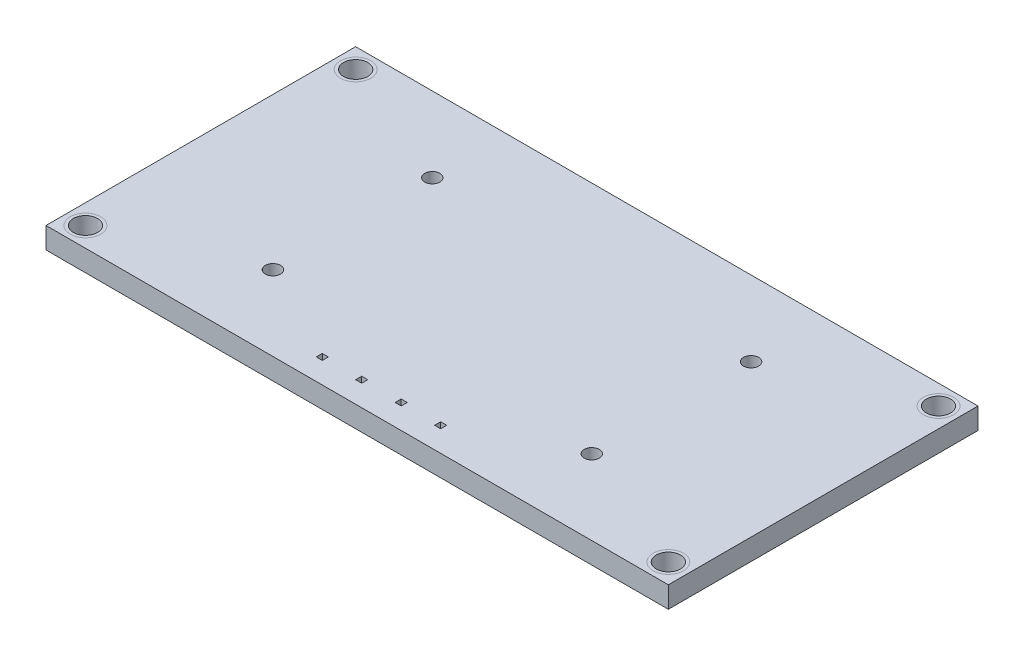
ISO-10303-21;
HEADER;
FILE_DESCRIPTION(('STEP AP214'),'2;1');
FILE_NAME('part.step','',(''),(''),'','','');
FILE_SCHEMA(('AUTOMOTIVE_DESIGN { 1 0 10303 214 1 1 1 1 }'));
ENDSEC;
DATA;
#1=APPLICATION_CONTEXT('core data for automotive mechanical design processes');
#2=APPLICATION_PROTOCOL_DEFINITION('international standard','automotive_design',2000,#1);
#3=PRODUCT_CONTEXT('',#1,'mechanical');
#4=PRODUCT('Part','Part','',(#3));
#5=PRODUCT_RELATED_PRODUCT_CATEGORY('part','',(#4));
#6=PRODUCT_DEFINITION_FORMATION('','',#4);
#7=PRODUCT_DEFINITION_CONTEXT('part definition',#1,'design');
#8=PRODUCT_DEFINITION('design','',#6,#7);
#9=PRODUCT_DEFINITION_SHAPE('','',#8);
#10=(LENGTH_UNIT() NAMED_UNIT(*) SI_UNIT(.MILLI.,.METRE.));
#11=(NAMED_UNIT(*) PLANE_ANGLE_UNIT() SI_UNIT($,.RADIAN.));
#12=(NAMED_UNIT(*) SI_UNIT($,.STERADIAN.) SOLID_ANGLE_UNIT());
#13=UNCERTAINTY_MEASURE_WITH_UNIT(LENGTH_MEASURE(1.E-05),#10,'distance_accuracy_value','');
#14=(GEOMETRIC_REPRESENTATION_CONTEXT(3) GLOBAL_UNCERTAINTY_ASSIGNED_CONTEXT((#13)) GLOBAL_UNIT_ASSIGNED_CONTEXT((#10,
#11,#12)) REPRESENTATION_CONTEXT('',''));
#15=CARTESIAN_POINT('',(0.,0.,0.));
#16=DIRECTION('',(0.,0.,1.));
#17=DIRECTION('',(1.,0.,0.));
#18=AXIS2_PLACEMENT_3D('',#15,#16,#17);
#19=CARTESIAN_POINT('',(19.2,1.4,-8.9));
#20=DIRECTION('',(0.,-1.,0.));
#21=DIRECTION('',(0.,0.,-1.));
#22=AXIS2_PLACEMENT_3D('',#19,#20,#21);
#23=CYLINDRICAL_SURFACE('',#22,0.800000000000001);
#24=CARTESIAN_POINT('',(19.2,0.,-8.9));
#25=DIRECTION('',(0.,-1.,0.));
#26=DIRECTION('',(0.,0.,-1.));
#27=AXIS2_PLACEMENT_3D('',#24,#25,#26);
#28=CIRCLE('',#27,0.800000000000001);
#29=CARTESIAN_POINT('',(19.2,0.,-9.7));
#30=VERTEX_POINT('',#29);
#31=EDGE_CURVE('P0_E28',#30,#30,#28,.T.);
#32=ORIENTED_EDGE('',*,*,#31,.T.);
#33=EDGE_LOOP('',(#32));
#34=FACE_BOUND('',#33,.T.);
#35=CARTESIAN_POINT('',(19.2,1.4,-8.9));
#36=DIRECTION('',(0.,-1.,0.));
#37=DIRECTION('',(0.,0.,-1.));
#38=AXIS2_PLACEMENT_3D('',#35,#36,#37);
#39=CIRCLE('',#38,0.800000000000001);
#40=CARTESIAN_POINT('',(19.2,1.4,-9.7));
#41=VERTEX_POINT('',#40);
#42=EDGE_CURVE('P0_E19',#41,#41,#39,.T.);
#43=ORIENTED_EDGE('',*,*,#42,.F.);
#44=EDGE_LOOP('',(#43));
#45=FACE_BOUND('',#44,.T.);
#46=ADVANCED_FACE('P0_F15',(#34,#45),#23,.F.);
#47=CARTESIAN_POINT('',(0.,1.4,0.));
#48=DIRECTION('',(0.,1.,0.));
#49=DIRECTION('',(0.,0.,1.));
#50=AXIS2_PLACEMENT_3D('',#47,#48,#49);
#51=PLANE('',#50);
#52=ORIENTED_EDGE('',*,*,#42,.T.);
#53=EDGE_LOOP('',(#52));
#54=FACE_BOUND('',#53,.T.);
#55=CARTESIAN_POINT('',(19.2,1.4,-8.9));
#56=DIRECTION('',(0.,1.,0.));
#57=DIRECTION('',(0.,0.,1.));
#58=AXIS2_PLACEMENT_3D('',#55,#56,#57);
#59=CIRCLE('',#58,1.);
#60=CARTESIAN_POINT('',(19.2,1.4,-7.9));
#61=VERTEX_POINT('',#60);
#62=EDGE_CURVE('P0_E23',#61,#61,#59,.F.);
#63=ORIENTED_EDGE('',*,*,#62,.F.);
#64=EDGE_LOOP('',(#63));
#65=FACE_BOUND('',#64,.T.);
#66=ADVANCED_FACE('P0_F36',(#54,#65),#51,.T.);
#67=CARTESIAN_POINT('',(0.,0.,0.));
#68=DIRECTION('',(0.,1.,0.));
#69=DIRECTION('',(0.,0.,1.));
#70=AXIS2_PLACEMENT_3D('',#67,#68,#69);
#71=PLANE('',#70);
#72=ORIENTED_EDGE('',*,*,#31,.F.);
#73=EDGE_LOOP('',(#72));
#74=FACE_BOUND('',#73,.T.);
#75=CARTESIAN_POINT('',(19.2,0.,-8.9));
#76=DIRECTION('',(0.,1.,0.));
#77=DIRECTION('',(0.,0.,1.));
#78=AXIS2_PLACEMENT_3D('',#75,#76,#77);
#79=CIRCLE('',#78,1.);
#80=CARTESIAN_POINT('',(19.2,0.,-7.9));
#81=VERTEX_POINT('',#80);
#82=EDGE_CURVE('P0_E10',#81,#81,#79,.T.);
#83=ORIENTED_EDGE('',*,*,#82,.F.);
#84=EDGE_LOOP('',(#83));
#85=FACE_BOUND('',#84,.T.);
#86=ADVANCED_FACE('P0_F45',(#74,#85),#71,.F.);
#87=CARTESIAN_POINT('',(19.2,1.4,-8.9));
#88=DIRECTION('',(0.,1.,0.));
#89=DIRECTION('',(0.,0.,1.));
#90=AXIS2_PLACEMENT_3D('',#87,#88,#89);
#91=CYLINDRICAL_SURFACE('',#90,1.);
#92=ORIENTED_EDGE('',*,*,#82,.T.);
#93=EDGE_LOOP('',(#92));
#94=FACE_BOUND('',#93,.T.);
#95=ORIENTED_EDGE('',*,*,#62,.T.);
#96=EDGE_LOOP('',(#95));
#97=FACE_BOUND('',#96,.T.);
#98=ADVANCED_FACE('P0_F17',(#94,#97),#91,.T.);
#99=CLOSED_SHELL('',(#46,#66,#86,#98));
#100=MANIFOLD_SOLID_BREP('P0_B1',#99);
#101=CARTESIAN_POINT('',(-19.2,1.4,-8.9));
#102=DIRECTION('',(0.,-1.,0.));
#103=DIRECTION('',(0.,0.,-1.));
#104=AXIS2_PLACEMENT_3D('',#101,#102,#103);
#105=CYLINDRICAL_SURFACE('',#104,0.800000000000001);
#106=CARTESIAN_POINT('',(-19.2,0.,-8.9));
#107=DIRECTION('',(0.,-1.,0.));
#108=DIRECTION('',(0.,0.,-1.));
#109=AXIS2_PLACEMENT_3D('',#106,#107,#108);
#110=CIRCLE('',#109,0.800000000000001);
#111=CARTESIAN_POINT('',(-19.2,0.,-9.7));
#112=VERTEX_POINT('',#111);
#113=EDGE_CURVE('P1_E28',#112,#112,#110,.T.);
#114=ORIENTED_EDGE('',*,*,#113,.T.);
#115=EDGE_LOOP('',(#114));
#116=FACE_BOUND('',#115,.T.);
#117=CARTESIAN_POINT('',(-19.2,1.4,-8.9));
#118=DIRECTION('',(0.,-1.,0.));
#119=DIRECTION('',(0.,0.,-1.));
#120=AXIS2_PLACEMENT_3D('',#117,#118,#119);
#121=CIRCLE('',#120,0.800000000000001);
#122=CARTESIAN_POINT('',(-19.2,1.4,-9.7));
#123=VERTEX_POINT('',#122);
#124=EDGE_CURVE('P1_E19',#123,#123,#121,.T.);
#125=ORIENTED_EDGE('',*,*,#124,.F.);
#126=EDGE_LOOP('',(#125));
#127=FACE_BOUND('',#126,.T.);
#128=ADVANCED_FACE('P1_F15',(#116,#127),#105,.F.);
#129=CARTESIAN_POINT('',(0.,1.4,0.));
#130=DIRECTION('',(0.,1.,0.));
#131=DIRECTION('',(0.,0.,1.));
#132=AXIS2_PLACEMENT_3D('',#129,#130,#131);
#133=PLANE('',#132);
#134=ORIENTED_EDGE('',*,*,#124,.T.);
#135=EDGE_LOOP('',(#134));
#136=FACE_BOUND('',#135,.T.);
#137=CARTESIAN_POINT('',(-19.2,1.4,-8.9));
#138=DIRECTION('',(0.,1.,0.));
#139=DIRECTION('',(0.,0.,1.));
#140=AXIS2_PLACEMENT_3D('',#137,#138,#139);
#141=CIRCLE('',#140,1.);
#142=CARTESIAN_POINT('',(-19.2,1.4,-7.9));
#143=VERTEX_POINT('',#142);
#144=EDGE_CURVE('P1_E23',#143,#143,#141,.F.);
#145=ORIENTED_EDGE('',*,*,#144,.F.);
#146=EDGE_LOOP('',(#145));
#147=FACE_BOUND('',#146,.T.);
#148=ADVANCED_FACE('P1_F36',(#136,#147),#133,.T.);
#149=CARTESIAN_POINT('',(0.,0.,0.));
#150=DIRECTION('',(0.,1.,0.));
#151=DIRECTION('',(0.,0.,1.));
#152=AXIS2_PLACEMENT_3D('',#149,#150,#151);
#153=PLANE('',#152);
#154=ORIENTED_EDGE('',*,*,#113,.F.);
#155=EDGE_LOOP('',(#154));
#156=FACE_BOUND('',#155,.T.);
#157=CARTESIAN_POINT('',(-19.2,0.,-8.9));
#158=DIRECTION('',(0.,1.,0.));
#159=DIRECTION('',(0.,0.,1.));
#160=AXIS2_PLACEMENT_3D('',#157,#158,#159);
#161=CIRCLE('',#160,1.);
#162=CARTESIAN_POINT('',(-19.2,0.,-7.9));
#163=VERTEX_POINT('',#162);
#164=EDGE_CURVE('P1_E10',#163,#163,#161,.T.);
#165=ORIENTED_EDGE('',*,*,#164,.F.);
#166=EDGE_LOOP('',(#165));
#167=FACE_BOUND('',#166,.T.);
#168=ADVANCED_FACE('P1_F45',(#156,#167),#153,.F.);
#169=CARTESIAN_POINT('',(-19.2,1.4,-8.9));
#170=DIRECTION('',(0.,1.,0.));
#171=DIRECTION('',(0.,0.,1.));
#172=AXIS2_PLACEMENT_3D('',#169,#170,#171);
#173=CYLINDRICAL_SURFACE('',#172,1.);
#174=ORIENTED_EDGE('',*,*,#164,.T.);
#175=EDGE_LOOP('',(#174));
#176=FACE_BOUND('',#175,.T.);
#177=ORIENTED_EDGE('',*,*,#144,.T.);
#178=EDGE_LOOP('',(#177));
#179=FACE_BOUND('',#178,.T.);
#180=ADVANCED_FACE('P1_F17',(#176,#179),#173,.T.);
#181=CLOSED_SHELL('',(#128,#148,#168,#180));
#182=MANIFOLD_SOLID_BREP('P1_B1',#181);
#183=CARTESIAN_POINT('',(19.2,1.4,8.9));
#184=DIRECTION('',(0.,-1.,0.));
#185=DIRECTION('',(0.,0.,-1.));
#186=AXIS2_PLACEMENT_3D('',#183,#184,#185);
#187=CYLINDRICAL_SURFACE('',#186,0.800000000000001);
#188=CARTESIAN_POINT('',(19.2,0.,8.9));
#189=DIRECTION('',(0.,-1.,0.));
#190=DIRECTION('',(0.,0.,-1.));
#191=AXIS2_PLACEMENT_3D('',#188,#189,#190);
#192=CIRCLE('',#191,0.800000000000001);
#193=CARTESIAN_POINT('',(19.2,0.,8.1));
#194=VERTEX_POINT('',#193);
#195=EDGE_CURVE('P2_E28',#194,#194,#192,.T.);
#196=ORIENTED_EDGE('',*,*,#195,.T.);
#197=EDGE_LOOP('',(#196));
#198=FACE_BOUND('',#197,.T.);
#199=CARTESIAN_POINT('',(19.2,1.4,8.9));
#200=DIRECTION('',(0.,-1.,0.));
#201=DIRECTION('',(0.,0.,-1.));
#202=AXIS2_PLACEMENT_3D('',#199,#200,#201);
#203=CIRCLE('',#202,0.800000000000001);
#204=CARTESIAN_POINT('',(19.2,1.4,8.1));
#205=VERTEX_POINT('',#204);
#206=EDGE_CURVE('P2_E19',#205,#205,#203,.T.);
#207=ORIENTED_EDGE('',*,*,#206,.F.);
#208=EDGE_LOOP('',(#207));
#209=FACE_BOUND('',#208,.T.);
#210=ADVANCED_FACE('P2_F15',(#198,#209),#187,.F.);
#211=CARTESIAN_POINT('',(0.,1.4,0.));
#212=DIRECTION('',(0.,1.,0.));
#213=DIRECTION('',(0.,0.,1.));
#214=AXIS2_PLACEMENT_3D('',#211,#212,#213);
#215=PLANE('',#214);
#216=ORIENTED_EDGE('',*,*,#206,.T.);
#217=EDGE_LOOP('',(#216));
#218=FACE_BOUND('',#217,.T.);
#219=CARTESIAN_POINT('',(19.2,1.4,8.9));
#220=DIRECTION('',(0.,1.,0.));
#221=DIRECTION('',(0.,0.,1.));
#222=AXIS2_PLACEMENT_3D('',#219,#220,#221);
#223=CIRCLE('',#222,1.);
#224=CARTESIAN_POINT('',(19.2,1.4,9.9));
#225=VERTEX_POINT('',#224);
#226=EDGE_CURVE('P2_E23',#225,#225,#223,.F.);
#227=ORIENTED_EDGE('',*,*,#226,.F.);
#228=EDGE_LOOP('',(#227));
#229=FACE_BOUND('',#228,.T.);
#230=ADVANCED_FACE('P2_F36',(#218,#229),#215,.T.);
#231=CARTESIAN_POINT('',(0.,0.,0.));
#232=DIRECTION('',(0.,1.,0.));
#233=DIRECTION('',(0.,0.,1.));
#234=AXIS2_PLACEMENT_3D('',#231,#232,#233);
#235=PLANE('',#234);
#236=ORIENTED_EDGE('',*,*,#195,.F.);
#237=EDGE_LOOP('',(#236));
#238=FACE_BOUND('',#237,.T.);
#239=CARTESIAN_POINT('',(19.2,0.,8.9));
#240=DIRECTION('',(0.,1.,0.));
#241=DIRECTION('',(0.,0.,1.));
#242=AXIS2_PLACEMENT_3D('',#239,#240,#241);
#243=CIRCLE('',#242,1.);
#244=CARTESIAN_POINT('',(19.2,0.,9.9));
#245=VERTEX_POINT('',#244);
#246=EDGE_CURVE('P2_E10',#245,#245,#243,.T.);
#247=ORIENTED_EDGE('',*,*,#246,.F.);
#248=EDGE_LOOP('',(#247));
#249=FACE_BOUND('',#248,.T.);
#250=ADVANCED_FACE('P2_F45',(#238,#249),#235,.F.);
#251=CARTESIAN_POINT('',(19.2,1.4,8.9));
#252=DIRECTION('',(0.,1.,0.));
#253=DIRECTION('',(0.,0.,1.));
#254=AXIS2_PLACEMENT_3D('',#251,#252,#253);
#255=CYLINDRICAL_SURFACE('',#254,1.);
#256=ORIENTED_EDGE('',*,*,#246,.T.);
#257=EDGE_LOOP('',(#256));
#258=FACE_BOUND('',#257,.T.);
#259=ORIENTED_EDGE('',*,*,#226,.T.);
#260=EDGE_LOOP('',(#259));
#261=FACE_BOUND('',#260,.T.);
#262=ADVANCED_FACE('P2_F17',(#258,#261),#255,.T.);
#263=CLOSED_SHELL('',(#210,#230,#250,#262));
#264=MANIFOLD_SOLID_BREP('P2_B1',#263);
#265=CARTESIAN_POINT('',(4.1,-4.2,15.6));
#266=DIRECTION('',(1.,0.,0.));
#267=DIRECTION('',(0.,0.,-1.));
#268=AXIS2_PLACEMENT_3D('',#265,#266,#267);
#269=PLANE('',#268);
#270=DIRECTION('',(0.,1.,0.));
#271=VECTOR('',#270,1.);
#272=CARTESIAN_POINT('',(4.1,-4.,8.4));
#273=LINE('',#272,#271);
#274=CARTESIAN_POINT('',(4.1,1.4,8.4));
#275=VERTEX_POINT('',#274);
#276=CARTESIAN_POINT('',(4.1,0.,8.4));
#277=VERTEX_POINT('',#276);
#278=EDGE_CURVE('P3_E166',#275,#277,#273,.F.);
#279=ORIENTED_EDGE('',*,*,#278,.T.);
#280=DIRECTION('',(0.,0.,-1.));
#281=VECTOR('',#280,1.);
#282=CARTESIAN_POINT('',(4.1,0.,15.6));
#283=LINE('',#282,#281);
#284=CARTESIAN_POINT('',(4.1,0.,8.8));
#285=VERTEX_POINT('',#284);
#286=EDGE_CURVE('P3_E173',#285,#277,#283,.T.);
#287=ORIENTED_EDGE('',*,*,#286,.F.);
#288=DIRECTION('',(0.,1.,0.));
#289=VECTOR('',#288,1.);
#290=CARTESIAN_POINT('',(4.1,-4.,8.8));
#291=LINE('',#290,#289);
#292=CARTESIAN_POINT('',(4.1,1.4,8.8));
#293=VERTEX_POINT('',#292);
#294=EDGE_CURVE('P3_E169',#285,#293,#291,.T.);
#295=ORIENTED_EDGE('',*,*,#294,.T.);
#296=DIRECTION('',(0.,0.,-1.));
#297=VECTOR('',#296,1.);
#298=CARTESIAN_POINT('',(4.1,1.4,15.6));
#299=LINE('',#298,#297);
#300=EDGE_CURVE('P3_E163',#275,#293,#299,.F.);
#301=ORIENTED_EDGE('',*,*,#300,.F.);
#302=EDGE_LOOP('',(#279,#287,#295,#301));
#303=FACE_BOUND('',#302,.T.);
#304=ADVANCED_FACE('P3_F17',(#303),#269,.F.);
#305=CARTESIAN_POINT('',(1.5,-4.2,15.6));
#306=DIRECTION('',(1.,0.,0.));
#307=DIRECTION('',(0.,0.,-1.));
#308=AXIS2_PLACEMENT_3D('',#305,#306,#307);
#309=PLANE('',#308);
#310=DIRECTION('',(0.,1.,0.));
#311=VECTOR('',#310,1.);
#312=CARTESIAN_POINT('',(1.5,-4.,8.4));
#313=LINE('',#312,#311);
#314=CARTESIAN_POINT('',(1.5,1.4,8.4));
#315=VERTEX_POINT('',#314);
#316=CARTESIAN_POINT('',(1.5,0.,8.4));
#317=VERTEX_POINT('',#316);
#318=EDGE_CURVE('P3_E194',#315,#317,#313,.F.);
#319=ORIENTED_EDGE('',*,*,#318,.T.);
#320=DIRECTION('',(0.,0.,-1.));
#321=VECTOR('',#320,1.);
#322=CARTESIAN_POINT('',(1.5,0.,15.6));
#323=LINE('',#322,#321);
#324=CARTESIAN_POINT('',(1.5,0.,8.8));
#325=VERTEX_POINT('',#324);
#326=EDGE_CURVE('P3_E172',#325,#317,#323,.T.);
#327=ORIENTED_EDGE('',*,*,#326,.F.);
#328=DIRECTION('',(0.,1.,0.));
#329=VECTOR('',#328,1.);
#330=CARTESIAN_POINT('',(1.5,-4.,8.8));
#331=LINE('',#330,#329);
#332=CARTESIAN_POINT('',(1.5,1.4,8.8));
#333=VERTEX_POINT('',#332);
#334=EDGE_CURVE('P3_E199',#325,#333,#331,.T.);
#335=ORIENTED_EDGE('',*,*,#334,.T.);
#336=DIRECTION('',(0.,0.,-1.));
#337=VECTOR('',#336,1.);
#338=CARTESIAN_POINT('',(1.5,1.4,15.6));
#339=LINE('',#338,#337);
#340=EDGE_CURVE('P3_E401',#315,#333,#339,.F.);
#341=ORIENTED_EDGE('',*,*,#340,.F.);
#342=EDGE_LOOP('',(#319,#327,#335,#341));
#343=FACE_BOUND('',#342,.T.);
#344=ADVANCED_FACE('P3_F419',(#343),#309,.F.);
#345=CARTESIAN_POINT('',(-1.1,-4.2,15.6));
#346=DIRECTION('',(1.,0.,0.));
#347=DIRECTION('',(0.,0.,-1.));
#348=AXIS2_PLACEMENT_3D('',#345,#346,#347);
#349=PLANE('',#348);
#350=DIRECTION('',(0.,1.,0.));
#351=VECTOR('',#350,1.);
#352=CARTESIAN_POINT('',(-1.1,-4.,8.4));
#353=LINE('',#352,#351);
#354=CARTESIAN_POINT('',(-1.1,1.4,8.4));
#355=VERTEX_POINT('',#354);
#356=CARTESIAN_POINT('',(-1.1,0.,8.4));
#357=VERTEX_POINT('',#356);
#358=EDGE_CURVE('P3_E204',#355,#357,#353,.F.);
#359=ORIENTED_EDGE('',*,*,#358,.T.);
#360=DIRECTION('',(0.,0.,-1.));
#361=VECTOR('',#360,1.);
#362=CARTESIAN_POINT('',(-1.1,0.,15.6));
#363=LINE('',#362,#361);
#364=CARTESIAN_POINT('',(-1.1,0.,8.8));
#365=VERTEX_POINT('',#364);
#366=EDGE_CURVE('P3_E420',#365,#357,#363,.T.);
#367=ORIENTED_EDGE('',*,*,#366,.F.);
#368=DIRECTION('',(0.,1.,0.));
#369=VECTOR('',#368,1.);
#370=CARTESIAN_POINT('',(-1.1,-4.,8.8));
#371=LINE('',#370,#369);
#372=CARTESIAN_POINT('',(-1.1,1.4,8.8));
#373=VERTEX_POINT('',#372);
#374=EDGE_CURVE('P3_E210',#365,#373,#371,.T.);
#375=ORIENTED_EDGE('',*,*,#374,.T.);
#376=DIRECTION('',(0.,0.,-1.));
#377=VECTOR('',#376,1.);
#378=CARTESIAN_POINT('',(-1.1,1.4,15.6));
#379=LINE('',#378,#377);
#380=EDGE_CURVE('P3_E422',#355,#373,#379,.F.);
#381=ORIENTED_EDGE('',*,*,#380,.F.);
#382=EDGE_LOOP('',(#359,#367,#375,#381));
#383=FACE_BOUND('',#382,.T.);
#384=ADVANCED_FACE('P3_F582',(#383),#349,.F.);
#385=CARTESIAN_POINT('',(-3.7,-4.2,15.6));
#386=DIRECTION('',(1.,0.,0.));
#387=DIRECTION('',(0.,0.,-1.));
#388=AXIS2_PLACEMENT_3D('',#385,#386,#387);
#389=PLANE('',#388);
#390=DIRECTION('',(0.,1.,0.));
#391=VECTOR('',#390,1.);
#392=CARTESIAN_POINT('',(-3.7,-4.,8.4));
#393=LINE('',#392,#391);
#394=CARTESIAN_POINT('',(-3.7,1.4,8.4));
#395=VERTEX_POINT('',#394);
#396=CARTESIAN_POINT('',(-3.7,0.,8.4));
#397=VERTEX_POINT('',#396);
#398=EDGE_CURVE('P3_E215',#395,#397,#393,.F.);
#399=ORIENTED_EDGE('',*,*,#398,.T.);
#400=DIRECTION('',(0.,0.,-1.));
#401=VECTOR('',#400,1.);
#402=CARTESIAN_POINT('',(-3.7,0.,15.6));
#403=LINE('',#402,#401);
#404=CARTESIAN_POINT('',(-3.7,0.,8.8));
#405=VERTEX_POINT('',#404);
#406=EDGE_CURVE('P3_E188',#405,#397,#403,.T.);
#407=ORIENTED_EDGE('',*,*,#406,.F.);
#408=DIRECTION('',(0.,1.,0.));
#409=VECTOR('',#408,1.);
#410=CARTESIAN_POINT('',(-3.7,-4.,8.8));
#411=LINE('',#410,#409);
#412=CARTESIAN_POINT('',(-3.7,1.4,8.8));
#413=VERTEX_POINT('',#412);
#414=EDGE_CURVE('P3_E221',#405,#413,#411,.T.);
#415=ORIENTED_EDGE('',*,*,#414,.T.);
#416=DIRECTION('',(0.,0.,-1.));
#417=VECTOR('',#416,1.);
#418=CARTESIAN_POINT('',(-3.7,1.4,15.6));
#419=LINE('',#418,#417);
#420=EDGE_CURVE('P3_E186',#395,#413,#419,.F.);
#421=ORIENTED_EDGE('',*,*,#420,.F.);
#422=EDGE_LOOP('',(#399,#407,#415,#421));
#423=FACE_BOUND('',#422,.T.);
#424=ADVANCED_FACE('P3_F432',(#423),#389,.F.);
#425=CARTESIAN_POINT('',(4.1,-4.,8.4));
#426=DIRECTION('',(0.,0.,-1.));
#427=DIRECTION('',(-1.,0.,0.));
#428=AXIS2_PLACEMENT_3D('',#425,#426,#427);
#429=PLANE('',#428);
#430=DIRECTION('',(0.,1.,0.));
#431=VECTOR('',#430,1.);
#432=CARTESIAN_POINT('',(3.7,-4.6,8.4));
#433=LINE('',#432,#431);
#434=CARTESIAN_POINT('',(3.7,1.4,8.4));
#435=VERTEX_POINT('',#434);
#436=CARTESIAN_POINT('',(3.7,0.,8.4));
#437=VERTEX_POINT('',#436);
#438=EDGE_CURVE('P3_E274',#435,#437,#433,.F.);
#439=ORIENTED_EDGE('',*,*,#438,.T.);
#440=DIRECTION('',(1.,0.,0.));
#441=VECTOR('',#440,1.);
#442=CARTESIAN_POINT('',(0.,0.,8.4));
#443=LINE('',#442,#441);
#444=EDGE_CURVE('P3_E185',#437,#277,#443,.T.);
#445=ORIENTED_EDGE('',*,*,#444,.T.);
#446=ORIENTED_EDGE('',*,*,#278,.F.);
#447=DIRECTION('',(-1.,0.,0.));
#448=VECTOR('',#447,1.);
#449=CARTESIAN_POINT('',(4.1,1.4,8.4));
#450=LINE('',#449,#448);
#451=EDGE_CURVE('P3_E176',#435,#275,#450,.F.);
#452=ORIENTED_EDGE('',*,*,#451,.F.);
#453=EDGE_LOOP('',(#439,#445,#446,#452));
#454=FACE_BOUND('',#453,.T.);
#455=ADVANCED_FACE('P3_F183',(#454),#429,.F.);
#456=CARTESIAN_POINT('',(3.7,-4.,8.8));
#457=DIRECTION('',(0.,0.,1.));
#458=DIRECTION('',(1.,0.,0.));
#459=AXIS2_PLACEMENT_3D('',#456,#457,#458);
#460=PLANE('',#459);
#461=ORIENTED_EDGE('',*,*,#294,.F.);
#462=DIRECTION('',(1.,0.,0.));
#463=VECTOR('',#462,1.);
#464=CARTESIAN_POINT('',(0.,0.,8.8));
#465=LINE('',#464,#463);
#466=CARTESIAN_POINT('',(3.7,0.,8.8));
#467=VERTEX_POINT('',#466);
#468=EDGE_CURVE('P3_E225',#285,#467,#465,.F.);
#469=ORIENTED_EDGE('',*,*,#468,.T.);
#470=DIRECTION('',(0.,1.,0.));
#471=VECTOR('',#470,1.);
#472=CARTESIAN_POINT('',(3.7,-4.6,8.8));
#473=LINE('',#472,#471);
#474=CARTESIAN_POINT('',(3.7,1.4,8.8));
#475=VERTEX_POINT('',#474);
#476=EDGE_CURVE('P3_E267',#467,#475,#473,.T.);
#477=ORIENTED_EDGE('',*,*,#476,.T.);
#478=DIRECTION('',(1.,0.,0.));
#479=VECTOR('',#478,1.);
#480=CARTESIAN_POINT('',(3.7,1.4,8.8));
#481=LINE('',#480,#479);
#482=EDGE_CURVE('P3_E192',#293,#475,#481,.F.);
#483=ORIENTED_EDGE('',*,*,#482,.F.);
#484=EDGE_LOOP('',(#461,#469,#477,#483));
#485=FACE_BOUND('',#484,.T.);
#486=ADVANCED_FACE('P3_F595',(#485),#460,.F.);
#487=CARTESIAN_POINT('',(1.5,-4.,8.4));
#488=DIRECTION('',(0.,0.,-1.));
#489=DIRECTION('',(-1.,0.,0.));
#490=AXIS2_PLACEMENT_3D('',#487,#488,#489);
#491=PLANE('',#490);
#492=DIRECTION('',(0.,1.,0.));
#493=VECTOR('',#492,1.);
#494=CARTESIAN_POINT('',(1.1,-4.6,8.4));
#495=LINE('',#494,#493);
#496=CARTESIAN_POINT('',(1.1,1.4,8.4));
#497=VERTEX_POINT('',#496);
#498=CARTESIAN_POINT('',(1.1,0.,8.4));
#499=VERTEX_POINT('',#498);
#500=EDGE_CURVE('P3_E270',#497,#499,#495,.F.);
#501=ORIENTED_EDGE('',*,*,#500,.T.);
#502=DIRECTION('',(1.,0.,0.));
#503=VECTOR('',#502,1.);
#504=CARTESIAN_POINT('',(0.,0.,8.4));
#505=LINE('',#504,#503);
#506=EDGE_CURVE('P3_E238',#499,#317,#505,.T.);
#507=ORIENTED_EDGE('',*,*,#506,.T.);
#508=ORIENTED_EDGE('',*,*,#318,.F.);
#509=DIRECTION('',(-1.,0.,0.));
#510=VECTOR('',#509,1.);
#511=CARTESIAN_POINT('',(1.5,1.4,8.4));
#512=LINE('',#511,#510);
#513=EDGE_CURVE('P3_E196',#497,#315,#512,.F.);
#514=ORIENTED_EDGE('',*,*,#513,.F.);
#515=EDGE_LOOP('',(#501,#507,#508,#514));
#516=FACE_BOUND('',#515,.T.);
#517=ADVANCED_FACE('P3_F413',(#516),#491,.F.);
#518=CARTESIAN_POINT('',(1.1,-4.,8.8));
#519=DIRECTION('',(0.,0.,1.));
#520=DIRECTION('',(1.,0.,0.));
#521=AXIS2_PLACEMENT_3D('',#518,#519,#520);
#522=PLANE('',#521);
#523=ORIENTED_EDGE('',*,*,#334,.F.);
#524=DIRECTION('',(1.,0.,0.));
#525=VECTOR('',#524,1.);
#526=CARTESIAN_POINT('',(0.,0.,8.8));
#527=LINE('',#526,#525);
#528=CARTESIAN_POINT('',(1.1,0.,8.8));
#529=VERTEX_POINT('',#528);
#530=EDGE_CURVE('P3_E241',#325,#529,#527,.F.);
#531=ORIENTED_EDGE('',*,*,#530,.T.);
#532=DIRECTION('',(0.,1.,0.));
#533=VECTOR('',#532,1.);
#534=CARTESIAN_POINT('',(1.1,-4.6,8.8));
#535=LINE('',#534,#533);
#536=CARTESIAN_POINT('',(1.1,1.4,8.8));
#537=VERTEX_POINT('',#536);
#538=EDGE_CURVE('P3_E277',#529,#537,#535,.T.);
#539=ORIENTED_EDGE('',*,*,#538,.T.);
#540=DIRECTION('',(1.,0.,0.));
#541=VECTOR('',#540,1.);
#542=CARTESIAN_POINT('',(1.1,1.4,8.8));
#543=LINE('',#542,#541);
#544=EDGE_CURVE('P3_E202',#333,#537,#543,.F.);
#545=ORIENTED_EDGE('',*,*,#544,.F.);
#546=EDGE_LOOP('',(#523,#531,#539,#545));
#547=FACE_BOUND('',#546,.T.);
#548=ADVANCED_FACE('P3_F405',(#547),#522,.F.);
#549=CARTESIAN_POINT('',(-1.1,-4.,8.4));
#550=DIRECTION('',(0.,0.,-1.));
#551=DIRECTION('',(-1.,0.,0.));
#552=AXIS2_PLACEMENT_3D('',#549,#550,#551);
#553=PLANE('',#552);
#554=DIRECTION('',(0.,1.,0.));
#555=VECTOR('',#554,1.);
#556=CARTESIAN_POINT('',(-1.5,-4.6,8.4));
#557=LINE('',#556,#555);
#558=CARTESIAN_POINT('',(-1.5,1.4,8.4));
#559=VERTEX_POINT('',#558);
#560=CARTESIAN_POINT('',(-1.5,0.,8.4));
#561=VERTEX_POINT('',#560);
#562=EDGE_CURVE('P3_E280',#559,#561,#557,.F.);
#563=ORIENTED_EDGE('',*,*,#562,.T.);
#564=DIRECTION('',(1.,0.,0.));
#565=VECTOR('',#564,1.);
#566=CARTESIAN_POINT('',(0.,0.,8.4));
#567=LINE('',#566,#565);
#568=EDGE_CURVE('P3_E233',#561,#357,#567,.T.);
#569=ORIENTED_EDGE('',*,*,#568,.T.);
#570=ORIENTED_EDGE('',*,*,#358,.F.);
#571=DIRECTION('',(-1.,0.,0.));
#572=VECTOR('',#571,1.);
#573=CARTESIAN_POINT('',(-1.1,1.4,8.4));
#574=LINE('',#573,#572);
#575=EDGE_CURVE('P3_E207',#559,#355,#574,.F.);
#576=ORIENTED_EDGE('',*,*,#575,.F.);
#577=EDGE_LOOP('',(#563,#569,#570,#576));
#578=FACE_BOUND('',#577,.T.);
#579=ADVANCED_FACE('P3_F580',(#578),#553,.F.);
#580=CARTESIAN_POINT('',(-1.5,-4.,8.8));
#581=DIRECTION('',(0.,0.,1.));
#582=DIRECTION('',(1.,0.,0.));
#583=AXIS2_PLACEMENT_3D('',#580,#581,#582);
#584=PLANE('',#583);
#585=ORIENTED_EDGE('',*,*,#374,.F.);
#586=DIRECTION('',(1.,0.,0.));
#587=VECTOR('',#586,1.);
#588=CARTESIAN_POINT('',(0.,0.,8.8));
#589=LINE('',#588,#587);
#590=CARTESIAN_POINT('',(-1.5,0.,8.8));
#591=VERTEX_POINT('',#590);
#592=EDGE_CURVE('P3_E236',#365,#591,#589,.F.);
#593=ORIENTED_EDGE('',*,*,#592,.T.);
#594=DIRECTION('',(0.,1.,0.));
#595=VECTOR('',#594,1.);
#596=CARTESIAN_POINT('',(-1.5,-4.6,8.8));
#597=LINE('',#596,#595);
#598=CARTESIAN_POINT('',(-1.5,1.4,8.8));
#599=VERTEX_POINT('',#598);
#600=EDGE_CURVE('P3_E285',#591,#599,#597,.T.);
#601=ORIENTED_EDGE('',*,*,#600,.T.);
#602=DIRECTION('',(1.,0.,0.));
#603=VECTOR('',#602,1.);
#604=CARTESIAN_POINT('',(-1.5,1.4,8.8));
#605=LINE('',#604,#603);
#606=EDGE_CURVE('P3_E213',#373,#599,#605,.F.);
#607=ORIENTED_EDGE('',*,*,#606,.F.);
#608=EDGE_LOOP('',(#585,#593,#601,#607));
#609=FACE_BOUND('',#608,.T.);
#610=ADVANCED_FACE('P3_F450',(#609),#584,.F.);
#611=CARTESIAN_POINT('',(-3.7,-4.,8.4));
#612=DIRECTION('',(0.,0.,-1.));
#613=DIRECTION('',(-1.,0.,0.));
#614=AXIS2_PLACEMENT_3D('',#611,#612,#613);
#615=PLANE('',#614);
#616=DIRECTION('',(0.,1.,0.));
#617=VECTOR('',#616,1.);
#618=CARTESIAN_POINT('',(-4.1,-4.6,8.4));
#619=LINE('',#618,#617);
#620=CARTESIAN_POINT('',(-4.1,1.4,8.4));
#621=VERTEX_POINT('',#620);
#622=CARTESIAN_POINT('',(-4.1,0.,8.4));
#623=VERTEX_POINT('',#622);
#624=EDGE_CURVE('P3_E288',#621,#623,#619,.F.);
#625=ORIENTED_EDGE('',*,*,#624,.T.);
#626=DIRECTION('',(1.,0.,0.));
#627=VECTOR('',#626,1.);
#628=CARTESIAN_POINT('',(0.,0.,8.4));
#629=LINE('',#628,#627);
#630=EDGE_CURVE('P3_E228',#623,#397,#629,.T.);
#631=ORIENTED_EDGE('',*,*,#630,.T.);
#632=ORIENTED_EDGE('',*,*,#398,.F.);
#633=DIRECTION('',(-1.,0.,0.));
#634=VECTOR('',#633,1.);
#635=CARTESIAN_POINT('',(-3.7,1.4,8.4));
#636=LINE('',#635,#634);
#637=EDGE_CURVE('P3_E218',#621,#395,#636,.F.);
#638=ORIENTED_EDGE('',*,*,#637,.F.);
#639=EDGE_LOOP('',(#625,#631,#632,#638));
#640=FACE_BOUND('',#639,.T.);
#641=ADVANCED_FACE('P3_F434',(#640),#615,.F.);
#642=CARTESIAN_POINT('',(-4.1,-4.,8.8));
#643=DIRECTION('',(0.,0.,1.));
#644=DIRECTION('',(1.,0.,0.));
#645=AXIS2_PLACEMENT_3D('',#642,#643,#644);
#646=PLANE('',#645);
#647=ORIENTED_EDGE('',*,*,#414,.F.);
#648=DIRECTION('',(1.,0.,0.));
#649=VECTOR('',#648,1.);
#650=CARTESIAN_POINT('',(0.,0.,8.8));
#651=LINE('',#650,#649);
#652=CARTESIAN_POINT('',(-4.1,0.,8.8));
#653=VERTEX_POINT('',#652);
#654=EDGE_CURVE('P3_E80',#405,#653,#651,.F.);
#655=ORIENTED_EDGE('',*,*,#654,.T.);
#656=DIRECTION('',(0.,1.,0.));
#657=VECTOR('',#656,1.);
#658=CARTESIAN_POINT('',(-4.1,-4.6,8.8));
#659=LINE('',#658,#657);
#660=CARTESIAN_POINT('',(-4.1,1.4,8.8));
#661=VERTEX_POINT('',#660);
#662=EDGE_CURVE('P3_E293',#653,#661,#659,.T.);
#663=ORIENTED_EDGE('',*,*,#662,.T.);
#664=DIRECTION('',(1.,0.,0.));
#665=VECTOR('',#664,1.);
#666=CARTESIAN_POINT('',(-4.1,1.4,8.8));
#667=LINE('',#666,#665);
#668=EDGE_CURVE('P3_E36',#413,#661,#667,.F.);
#669=ORIENTED_EDGE('',*,*,#668,.F.);
#670=EDGE_LOOP('',(#647,#655,#663,#669));
#671=FACE_BOUND('',#670,.T.);
#672=ADVANCED_FACE('P3_F440',(#671),#646,.F.);
#673=CARTESIAN_POINT('',(0.,0.,0.));
#674=DIRECTION('',(0.,1.,0.));
#675=DIRECTION('',(0.,0.,1.));
#676=AXIS2_PLACEMENT_3D('',#673,#674,#675);
#677=PLANE('',#676);
#678=CARTESIAN_POINT('',(-10.5,0.,5.25));
#679=DIRECTION('',(0.,-1.,0.));
#680=DIRECTION('',(0.,0.,-1.));
#681=AXIS2_PLACEMENT_3D('',#678,#679,#680);
#682=CIRCLE('',#681,0.5);
#683=CARTESIAN_POINT('',(-10.5,0.,4.75));
#684=VERTEX_POINT('',#683);
#685=EDGE_CURVE('P3_E344',#684,#684,#682,.F.);
#686=ORIENTED_EDGE('',*,*,#685,.T.);
#687=EDGE_LOOP('',(#686));
#688=FACE_BOUND('',#687,.T.);
#689=CARTESIAN_POINT('',(-10.5,0.,-5.25));
#690=DIRECTION('',(0.,-1.,0.));
#691=DIRECTION('',(0.,0.,-1.));
#692=AXIS2_PLACEMENT_3D('',#689,#690,#691);
#693=CIRCLE('',#692,0.5);
#694=CARTESIAN_POINT('',(-10.5,0.,-5.75));
#695=VERTEX_POINT('',#694);
#696=EDGE_CURVE('P3_E295',#695,#695,#693,.F.);
#697=ORIENTED_EDGE('',*,*,#696,.T.);
#698=EDGE_LOOP('',(#697));
#699=FACE_BOUND('',#698,.T.);
#700=CARTESIAN_POINT('',(10.5,0.,5.25));
#701=DIRECTION('',(0.,-1.,0.));
#702=DIRECTION('',(0.,0.,-1.));
#703=AXIS2_PLACEMENT_3D('',#700,#701,#702);
#704=CIRCLE('',#703,0.5);
#705=CARTESIAN_POINT('',(10.5,0.,4.75));
#706=VERTEX_POINT('',#705);
#707=EDGE_CURVE('P3_E320',#706,#706,#704,.F.);
#708=ORIENTED_EDGE('',*,*,#707,.T.);
#709=EDGE_LOOP('',(#708));
#710=FACE_BOUND('',#709,.T.);
#711=CARTESIAN_POINT('',(10.5,0.,-5.25));
#712=DIRECTION('',(0.,-1.,0.));
#713=DIRECTION('',(0.,0.,-1.));
#714=AXIS2_PLACEMENT_3D('',#711,#712,#713);
#715=CIRCLE('',#714,0.5);
#716=CARTESIAN_POINT('',(10.5,0.,-5.75));
#717=VERTEX_POINT('',#716);
#718=EDGE_CURVE('P3_E341',#717,#717,#715,.F.);
#719=ORIENTED_EDGE('',*,*,#718,.T.);
#720=EDGE_LOOP('',(#719));
#721=FACE_BOUND('',#720,.T.);
#722=DIRECTION('',(0.,0.,1.));
#723=VECTOR('',#722,1.);
#724=CARTESIAN_POINT('',(-4.1,0.,15.6));
#725=LINE('',#724,#723);
#726=EDGE_CURVE('P3_E296',#623,#653,#725,.T.);
#727=ORIENTED_EDGE('',*,*,#726,.T.);
#728=ORIENTED_EDGE('',*,*,#654,.F.);
#729=ORIENTED_EDGE('',*,*,#406,.T.);
#730=ORIENTED_EDGE('',*,*,#630,.F.);
#731=EDGE_LOOP('',(#727,#728,#729,#730));
#732=FACE_BOUND('',#731,.T.);
#733=DIRECTION('',(0.,0.,1.));
#734=VECTOR('',#733,1.);
#735=CARTESIAN_POINT('',(-1.5,0.,15.6));
#736=LINE('',#735,#734);
#737=EDGE_CURVE('P3_E289',#561,#591,#736,.T.);
#738=ORIENTED_EDGE('',*,*,#737,.T.);
#739=ORIENTED_EDGE('',*,*,#592,.F.);
#740=ORIENTED_EDGE('',*,*,#366,.T.);
#741=ORIENTED_EDGE('',*,*,#568,.F.);
#742=EDGE_LOOP('',(#738,#739,#740,#741));
#743=FACE_BOUND('',#742,.T.);
#744=DIRECTION('',(0.,0.,1.));
#745=VECTOR('',#744,1.);
#746=CARTESIAN_POINT('',(1.1,0.,15.6));
#747=LINE('',#746,#745);
#748=EDGE_CURVE('P3_E281',#499,#529,#747,.T.);
#749=ORIENTED_EDGE('',*,*,#748,.T.);
#750=ORIENTED_EDGE('',*,*,#530,.F.);
#751=ORIENTED_EDGE('',*,*,#326,.T.);
#752=ORIENTED_EDGE('',*,*,#506,.F.);
#753=EDGE_LOOP('',(#749,#750,#751,#752));
#754=FACE_BOUND('',#753,.T.);
#755=DIRECTION('',(0.,0.,1.));
#756=VECTOR('',#755,1.);
#757=CARTESIAN_POINT('',(3.7,0.,15.6));
#758=LINE('',#757,#756);
#759=EDGE_CURVE('P3_E271',#437,#467,#758,.T.);
#760=ORIENTED_EDGE('',*,*,#759,.T.);
#761=ORIENTED_EDGE('',*,*,#468,.F.);
#762=ORIENTED_EDGE('',*,*,#286,.T.);
#763=ORIENTED_EDGE('',*,*,#444,.F.);
#764=EDGE_LOOP('',(#760,#761,#762,#763));
#765=FACE_BOUND('',#764,.T.);
#766=CARTESIAN_POINT('',(19.2,0.,-8.9));
#767=DIRECTION('',(0.,1.,0.));
#768=DIRECTION('',(0.,0.,1.));
#769=AXIS2_PLACEMENT_3D('',#766,#767,#768);
#770=CIRCLE('',#769,1.);
#771=CARTESIAN_POINT('',(19.2,0.,-7.9));
#772=VERTEX_POINT('',#771);
#773=EDGE_CURVE('P3_E276',#772,#772,#770,.T.);
#774=ORIENTED_EDGE('',*,*,#773,.T.);
#775=EDGE_LOOP('',(#774));
#776=FACE_BOUND('',#775,.T.);
#777=CARTESIAN_POINT('',(19.2,0.,8.9));
#778=DIRECTION('',(0.,1.,0.));
#779=DIRECTION('',(0.,0.,1.));
#780=AXIS2_PLACEMENT_3D('',#777,#778,#779);
#781=CIRCLE('',#780,1.);
#782=CARTESIAN_POINT('',(19.2,0.,9.9));
#783=VERTEX_POINT('',#782);
#784=EDGE_CURVE('P3_E351',#783,#783,#781,.T.);
#785=ORIENTED_EDGE('',*,*,#784,.T.);
#786=EDGE_LOOP('',(#785));
#787=FACE_BOUND('',#786,.T.);
#788=CARTESIAN_POINT('',(-19.2,0.,8.9));
#789=DIRECTION('',(0.,1.,0.));
#790=DIRECTION('',(0.,0.,1.));
#791=AXIS2_PLACEMENT_3D('',#788,#789,#790);
#792=CIRCLE('',#791,1.);
#793=CARTESIAN_POINT('',(-19.2,0.,9.9));
#794=VERTEX_POINT('',#793);
#795=EDGE_CURVE('P3_E353',#794,#794,#792,.T.);
#796=ORIENTED_EDGE('',*,*,#795,.T.);
#797=EDGE_LOOP('',(#796));
#798=FACE_BOUND('',#797,.T.);
#799=CARTESIAN_POINT('',(-19.2,0.,-8.9));
#800=DIRECTION('',(0.,1.,0.));
#801=DIRECTION('',(0.,0.,1.));
#802=AXIS2_PLACEMENT_3D('',#799,#800,#801);
#803=CIRCLE('',#802,1.);
#804=CARTESIAN_POINT('',(-19.2,0.,-7.9));
#805=VERTEX_POINT('',#804);
#806=EDGE_CURVE('P3_E21',#805,#805,#803,.T.);
#807=ORIENTED_EDGE('',*,*,#806,.T.);
#808=EDGE_LOOP('',(#807));
#809=FACE_BOUND('',#808,.T.);
#810=DIRECTION('',(1.,0.,0.));
#811=VECTOR('',#810,1.);
#812=CARTESIAN_POINT('',(-20.5,0.,10.2));
#813=LINE('',#812,#811);
#814=CARTESIAN_POINT('',(-20.5,0.,10.2));
#815=VERTEX_POINT('',#814);
#816=CARTESIAN_POINT('',(20.5,0.,10.2));
#817=VERTEX_POINT('',#816);
#818=EDGE_CURVE('P3_E257',#815,#817,#813,.T.);
#819=ORIENTED_EDGE('',*,*,#818,.F.);
#820=DIRECTION('',(0.,0.,1.));
#821=VECTOR('',#820,1.);
#822=CARTESIAN_POINT('',(-20.5,0.,-10.2));
#823=LINE('',#822,#821);
#824=CARTESIAN_POINT('',(-20.5,0.,-10.2));
#825=VERTEX_POINT('',#824);
#826=EDGE_CURVE('P3_E251',#825,#815,#823,.T.);
#827=ORIENTED_EDGE('',*,*,#826,.F.);
#828=DIRECTION('',(-1.,0.,0.));
#829=VECTOR('',#828,1.);
#830=CARTESIAN_POINT('',(20.5,0.,-10.2));
#831=LINE('',#830,#829);
#832=CARTESIAN_POINT('',(20.5,0.,-10.2));
#833=VERTEX_POINT('',#832);
#834=EDGE_CURVE('P3_E247',#833,#825,#831,.T.);
#835=ORIENTED_EDGE('',*,*,#834,.F.);
#836=DIRECTION('',(0.,0.,-1.));
#837=VECTOR('',#836,1.);
#838=CARTESIAN_POINT('',(20.5,0.,10.2));
#839=LINE('',#838,#837);
#840=EDGE_CURVE('P3_E231',#817,#833,#839,.T.);
#841=ORIENTED_EDGE('',*,*,#840,.F.);
#842=EDGE_LOOP('',(#819,#827,#835,#841));
#843=FACE_BOUND('',#842,.T.);
#844=ADVANCED_FACE('P3_F360',(#688,#699,#710,#721,#732,#743,#754,#765,#776,#787,#798,#809,#843),
#677,.F.);
#845=CARTESIAN_POINT('',(20.5,0.,10.2));
#846=DIRECTION('',(1.,0.,0.));
#847=DIRECTION('',(0.,0.,-1.));
#848=AXIS2_PLACEMENT_3D('',#845,#846,#847);
#849=PLANE('',#848);
#850=DIRECTION('',(0.,0.,1.));
#851=VECTOR('',#850,1.);
#852=CARTESIAN_POINT('',(20.5,1.4,0.));
#853=LINE('',#852,#851);
#854=CARTESIAN_POINT('',(20.5,1.4,10.2));
#855=VERTEX_POINT('',#854);
#856=CARTESIAN_POINT('',(20.5,1.4,-10.2));
#857=VERTEX_POINT('',#856);
#858=EDGE_CURVE('P3_E74',#855,#857,#853,.F.);
#859=ORIENTED_EDGE('',*,*,#858,.F.);
#860=DIRECTION('',(0.,1.,0.));
#861=VECTOR('',#860,1.);
#862=CARTESIAN_POINT('',(20.5,0.,10.2));
#863=LINE('',#862,#861);
#864=EDGE_CURVE('P3_E263',#817,#855,#863,.T.);
#865=ORIENTED_EDGE('',*,*,#864,.F.);
#866=ORIENTED_EDGE('',*,*,#840,.T.);
#867=DIRECTION('',(0.,1.,0.));
#868=VECTOR('',#867,1.);
#869=CARTESIAN_POINT('',(20.5,0.,-10.2));
#870=LINE('',#869,#868);
#871=EDGE_CURVE('P3_E248',#857,#833,#870,.F.);
#872=ORIENTED_EDGE('',*,*,#871,.F.);
#873=EDGE_LOOP('',(#859,#865,#866,#872));
#874=FACE_BOUND('',#873,.T.);
#875=ADVANCED_FACE('P3_F447',(#874),#849,.T.);
#876=CARTESIAN_POINT('',(20.5,0.,-10.2));
#877=DIRECTION('',(0.,0.,-1.));
#878=DIRECTION('',(-1.,0.,0.));
#879=AXIS2_PLACEMENT_3D('',#876,#877,#878);
#880=PLANE('',#879);
#881=DIRECTION('',(1.,0.,0.));
#882=VECTOR('',#881,1.);
#883=CARTESIAN_POINT('',(0.,1.4,-10.2));
#884=LINE('',#883,#882);
#885=CARTESIAN_POINT('',(-20.5,1.4,-10.2));
#886=VERTEX_POINT('',#885);
#887=EDGE_CURVE('P3_E317',#857,#886,#884,.F.);
#888=ORIENTED_EDGE('',*,*,#887,.F.);
#889=ORIENTED_EDGE('',*,*,#871,.T.);
#890=ORIENTED_EDGE('',*,*,#834,.T.);
#891=DIRECTION('',(0.,1.,0.));
#892=VECTOR('',#891,1.);
#893=CARTESIAN_POINT('',(-20.5,0.,-10.2));
#894=LINE('',#893,#892);
#895=EDGE_CURVE('P3_E254',#886,#825,#894,.F.);
#896=ORIENTED_EDGE('',*,*,#895,.F.);
#897=EDGE_LOOP('',(#888,#889,#890,#896));
#898=FACE_BOUND('',#897,.T.);
#899=ADVANCED_FACE('P3_F456',(#898),#880,.T.);
#900=CARTESIAN_POINT('',(-20.5,0.,-10.2));
#901=DIRECTION('',(-1.,0.,0.));
#902=DIRECTION('',(0.,0.,1.));
#903=AXIS2_PLACEMENT_3D('',#900,#901,#902);
#904=PLANE('',#903);
#905=DIRECTION('',(0.,0.,1.));
#906=VECTOR('',#905,1.);
#907=CARTESIAN_POINT('',(-20.5,1.4,0.));
#908=LINE('',#907,#906);
#909=CARTESIAN_POINT('',(-20.5,1.4,10.2));
#910=VERTEX_POINT('',#909);
#911=EDGE_CURVE('P3_E314',#886,#910,#908,.T.);
#912=ORIENTED_EDGE('',*,*,#911,.F.);
#913=ORIENTED_EDGE('',*,*,#895,.T.);
#914=ORIENTED_EDGE('',*,*,#826,.T.);
#915=DIRECTION('',(0.,1.,0.));
#916=VECTOR('',#915,1.);
#917=CARTESIAN_POINT('',(-20.5,0.,10.2));
#918=LINE('',#917,#916);
#919=EDGE_CURVE('P3_E260',#910,#815,#918,.F.);
#920=ORIENTED_EDGE('',*,*,#919,.F.);
#921=EDGE_LOOP('',(#912,#913,#914,#920));
#922=FACE_BOUND('',#921,.T.);
#923=ADVANCED_FACE('P3_F377',(#922),#904,.T.);
#924=CARTESIAN_POINT('',(-20.5,0.,10.2));
#925=DIRECTION('',(0.,0.,1.));
#926=DIRECTION('',(1.,0.,0.));
#927=AXIS2_PLACEMENT_3D('',#924,#925,#926);
#928=PLANE('',#927);
#929=DIRECTION('',(1.,0.,0.));
#930=VECTOR('',#929,1.);
#931=CARTESIAN_POINT('',(0.,1.4,10.2));
#932=LINE('',#931,#930);
#933=EDGE_CURVE('P3_E310',#910,#855,#932,.T.);
#934=ORIENTED_EDGE('',*,*,#933,.F.);
#935=ORIENTED_EDGE('',*,*,#919,.T.);
#936=ORIENTED_EDGE('',*,*,#818,.T.);
#937=ORIENTED_EDGE('',*,*,#864,.T.);
#938=EDGE_LOOP('',(#934,#935,#936,#937));
#939=FACE_BOUND('',#938,.T.);
#940=ADVANCED_FACE('P3_F366',(#939),#928,.T.);
#941=CARTESIAN_POINT('',(-19.2,1.4,-8.9));
#942=DIRECTION('',(0.,1.,0.));
#943=DIRECTION('',(0.,0.,1.));
#944=AXIS2_PLACEMENT_3D('',#941,#942,#943);
#945=CYLINDRICAL_SURFACE('',#944,1.);
#946=CARTESIAN_POINT('',(-19.2,1.4,-8.9));
#947=DIRECTION('',(0.,1.,0.));
#948=DIRECTION('',(0.,0.,1.));
#949=AXIS2_PLACEMENT_3D('',#946,#947,#948);
#950=CIRCLE('',#949,1.);
#951=CARTESIAN_POINT('',(-19.2,1.4,-7.9));
#952=VERTEX_POINT('',#951);
#953=EDGE_CURVE('P3_E313',#952,#952,#950,.F.);
#954=ORIENTED_EDGE('',*,*,#953,.F.);
#955=EDGE_LOOP('',(#954));
#956=FACE_BOUND('',#955,.T.);
#957=ORIENTED_EDGE('',*,*,#806,.F.);
#958=EDGE_LOOP('',(#957));
#959=FACE_BOUND('',#958,.T.);
#960=ADVANCED_FACE('P3_F363',(#956,#959),#945,.F.);
#961=CARTESIAN_POINT('',(-19.2,1.4,8.9));
#962=DIRECTION('',(0.,1.,0.));
#963=DIRECTION('',(0.,0.,1.));
#964=AXIS2_PLACEMENT_3D('',#961,#962,#963);
#965=CYLINDRICAL_SURFACE('',#964,1.);
#966=CARTESIAN_POINT('',(-19.2,1.4,8.9));
#967=DIRECTION('',(0.,1.,0.));
#968=DIRECTION('',(0.,0.,1.));
#969=AXIS2_PLACEMENT_3D('',#966,#967,#968);
#970=CIRCLE('',#969,1.);
#971=CARTESIAN_POINT('',(-19.2,1.4,9.9));
#972=VERTEX_POINT('',#971);
#973=EDGE_CURVE('P3_E334',#972,#972,#970,.F.);
#974=ORIENTED_EDGE('',*,*,#973,.F.);
#975=EDGE_LOOP('',(#974));
#976=FACE_BOUND('',#975,.T.);
#977=ORIENTED_EDGE('',*,*,#795,.F.);
#978=EDGE_LOOP('',(#977));
#979=FACE_BOUND('',#978,.T.);
#980=ADVANCED_FACE('P3_F365',(#976,#979),#965,.F.);
#981=CARTESIAN_POINT('',(19.2,1.4,8.9));
#982=DIRECTION('',(0.,1.,0.));
#983=DIRECTION('',(0.,0.,1.));
#984=AXIS2_PLACEMENT_3D('',#981,#982,#983);
#985=CYLINDRICAL_SURFACE('',#984,1.);
#986=CARTESIAN_POINT('',(19.2,1.4,8.9));
#987=DIRECTION('',(0.,1.,0.));
#988=DIRECTION('',(0.,0.,1.));
#989=AXIS2_PLACEMENT_3D('',#986,#987,#988);
#990=CIRCLE('',#989,1.);
#991=CARTESIAN_POINT('',(19.2,1.4,9.9));
#992=VERTEX_POINT('',#991);
#993=EDGE_CURVE('P3_E331',#992,#992,#990,.F.);
#994=ORIENTED_EDGE('',*,*,#993,.F.);
#995=EDGE_LOOP('',(#994));
#996=FACE_BOUND('',#995,.T.);
#997=ORIENTED_EDGE('',*,*,#784,.F.);
#998=EDGE_LOOP('',(#997));
#999=FACE_BOUND('',#998,.T.);
#1000=ADVANCED_FACE('P3_F374',(#996,#999),#985,.F.);
#1001=CARTESIAN_POINT('',(19.2,1.4,-8.9));
#1002=DIRECTION('',(0.,1.,0.));
#1003=DIRECTION('',(0.,0.,1.));
#1004=AXIS2_PLACEMENT_3D('',#1001,#1002,#1003);
#1005=CYLINDRICAL_SURFACE('',#1004,1.);
#1006=CARTESIAN_POINT('',(19.2,1.4,-8.9));
#1007=DIRECTION('',(0.,1.,0.));
#1008=DIRECTION('',(0.,0.,1.));
#1009=AXIS2_PLACEMENT_3D('',#1006,#1007,#1008);
#1010=CIRCLE('',#1009,1.);
#1011=CARTESIAN_POINT('',(19.2,1.4,-7.9));
#1012=VERTEX_POINT('',#1011);
#1013=EDGE_CURVE('P3_E309',#1012,#1012,#1010,.F.);
#1014=ORIENTED_EDGE('',*,*,#1013,.F.);
#1015=EDGE_LOOP('',(#1014));
#1016=FACE_BOUND('',#1015,.T.);
#1017=ORIENTED_EDGE('',*,*,#773,.F.);
#1018=EDGE_LOOP('',(#1017));
#1019=FACE_BOUND('',#1018,.T.);
#1020=ADVANCED_FACE('P3_F492',(#1016,#1019),#1005,.F.);
#1021=CARTESIAN_POINT('',(3.7,-4.6,15.6));
#1022=DIRECTION('',(-1.,0.,0.));
#1023=DIRECTION('',(0.,0.,1.));
#1024=AXIS2_PLACEMENT_3D('',#1021,#1022,#1023);
#1025=PLANE('',#1024);
#1026=ORIENTED_EDGE('',*,*,#476,.F.);
#1027=ORIENTED_EDGE('',*,*,#759,.F.);
#1028=ORIENTED_EDGE('',*,*,#438,.F.);
#1029=DIRECTION('',(0.,0.,1.));
#1030=VECTOR('',#1029,1.);
#1031=CARTESIAN_POINT('',(3.7,1.4,0.));
#1032=LINE('',#1031,#1030);
#1033=EDGE_CURVE('P3_E179',#475,#435,#1032,.F.);
#1034=ORIENTED_EDGE('',*,*,#1033,.F.);
#1035=EDGE_LOOP('',(#1026,#1027,#1028,#1034));
#1036=FACE_BOUND('',#1035,.T.);
#1037=ADVANCED_FACE('P3_F500',(#1036),#1025,.F.);
#1038=CARTESIAN_POINT('',(1.1,-4.6,15.6));
#1039=DIRECTION('',(-1.,0.,0.));
#1040=DIRECTION('',(0.,0.,1.));
#1041=AXIS2_PLACEMENT_3D('',#1038,#1039,#1040);
#1042=PLANE('',#1041);
#1043=ORIENTED_EDGE('',*,*,#538,.F.);
#1044=ORIENTED_EDGE('',*,*,#748,.F.);
#1045=ORIENTED_EDGE('',*,*,#500,.F.);
#1046=DIRECTION('',(0.,0.,1.));
#1047=VECTOR('',#1046,1.);
#1048=CARTESIAN_POINT('',(1.1,1.4,0.));
#1049=LINE('',#1048,#1047);
#1050=EDGE_CURVE('P3_E305',#537,#497,#1049,.F.);
#1051=ORIENTED_EDGE('',*,*,#1050,.F.);
#1052=EDGE_LOOP('',(#1043,#1044,#1045,#1051));
#1053=FACE_BOUND('',#1052,.T.);
#1054=ADVANCED_FACE('P3_F410',(#1053),#1042,.F.);
#1055=CARTESIAN_POINT('',(-1.5,-4.6,15.6));
#1056=DIRECTION('',(-1.,0.,0.));
#1057=DIRECTION('',(0.,0.,1.));
#1058=AXIS2_PLACEMENT_3D('',#1055,#1056,#1057);
#1059=PLANE('',#1058);
#1060=ORIENTED_EDGE('',*,*,#600,.F.);
#1061=ORIENTED_EDGE('',*,*,#737,.F.);
#1062=ORIENTED_EDGE('',*,*,#562,.F.);
#1063=DIRECTION('',(0.,0.,1.));
#1064=VECTOR('',#1063,1.);
#1065=CARTESIAN_POINT('',(-1.5,1.4,0.));
#1066=LINE('',#1065,#1064);
#1067=EDGE_CURVE('P3_E302',#599,#559,#1066,.F.);
#1068=ORIENTED_EDGE('',*,*,#1067,.F.);
#1069=EDGE_LOOP('',(#1060,#1061,#1062,#1068));
#1070=FACE_BOUND('',#1069,.T.);
#1071=ADVANCED_FACE('P3_F515',(#1070),#1059,.F.);
#1072=CARTESIAN_POINT('',(-4.1,-4.6,15.6));
#1073=DIRECTION('',(-1.,0.,0.));
#1074=DIRECTION('',(0.,0.,1.));
#1075=AXIS2_PLACEMENT_3D('',#1072,#1073,#1074);
#1076=PLANE('',#1075);
#1077=ORIENTED_EDGE('',*,*,#662,.F.);
#1078=ORIENTED_EDGE('',*,*,#726,.F.);
#1079=ORIENTED_EDGE('',*,*,#624,.F.);
#1080=DIRECTION('',(0.,0.,1.));
#1081=VECTOR('',#1080,1.);
#1082=CARTESIAN_POINT('',(-4.1,1.4,0.));
#1083=LINE('',#1082,#1081);
#1084=EDGE_CURVE('P3_E299',#661,#621,#1083,.F.);
#1085=ORIENTED_EDGE('',*,*,#1084,.F.);
#1086=EDGE_LOOP('',(#1077,#1078,#1079,#1085));
#1087=FACE_BOUND('',#1086,.T.);
#1088=ADVANCED_FACE('P3_F439',(#1087),#1076,.F.);
#1089=CARTESIAN_POINT('',(-10.5,1.4,-5.25));
#1090=DIRECTION('',(0.,-1.,0.));
#1091=DIRECTION('',(0.,0.,-1.));
#1092=AXIS2_PLACEMENT_3D('',#1089,#1090,#1091);
#1093=CYLINDRICAL_SURFACE('',#1092,0.5);
#1094=ORIENTED_EDGE('',*,*,#696,.F.);
#1095=EDGE_LOOP('',(#1094));
#1096=FACE_BOUND('',#1095,.T.);
#1097=CARTESIAN_POINT('',(-10.5,1.4,-5.25));
#1098=DIRECTION('',(0.,-1.,0.));
#1099=DIRECTION('',(0.,0.,-1.));
#1100=AXIS2_PLACEMENT_3D('',#1097,#1098,#1099);
#1101=CIRCLE('',#1100,0.5);
#1102=CARTESIAN_POINT('',(-10.5,1.4,-5.75));
#1103=VERTEX_POINT('',#1102);
#1104=EDGE_CURVE('P3_E301',#1103,#1103,#1101,.T.);
#1105=ORIENTED_EDGE('',*,*,#1104,.F.);
#1106=EDGE_LOOP('',(#1105));
#1107=FACE_BOUND('',#1106,.T.);
#1108=ADVANCED_FACE('P3_F529',(#1096,#1107),#1093,.F.);
#1109=CARTESIAN_POINT('',(-10.5,1.4,5.25));
#1110=DIRECTION('',(0.,-1.,0.));
#1111=DIRECTION('',(0.,0.,-1.));
#1112=AXIS2_PLACEMENT_3D('',#1109,#1110,#1111);
#1113=CYLINDRICAL_SURFACE('',#1112,0.5);
#1114=ORIENTED_EDGE('',*,*,#685,.F.);
#1115=EDGE_LOOP('',(#1114));
#1116=FACE_BOUND('',#1115,.T.);
#1117=CARTESIAN_POINT('',(-10.5,1.4,5.25));
#1118=DIRECTION('',(0.,-1.,0.));
#1119=DIRECTION('',(0.,0.,-1.));
#1120=AXIS2_PLACEMENT_3D('',#1117,#1118,#1119);
#1121=CIRCLE('',#1120,0.5);
#1122=CARTESIAN_POINT('',(-10.5,1.4,4.75));
#1123=VERTEX_POINT('',#1122);
#1124=EDGE_CURVE('P3_E324',#1123,#1123,#1121,.T.);
#1125=ORIENTED_EDGE('',*,*,#1124,.F.);
#1126=EDGE_LOOP('',(#1125));
#1127=FACE_BOUND('',#1126,.T.);
#1128=ADVANCED_FACE('P3_F536',(#1116,#1127),#1113,.F.);
#1129=CARTESIAN_POINT('',(10.5,1.4,-5.25));
#1130=DIRECTION('',(0.,-1.,0.));
#1131=DIRECTION('',(0.,0.,-1.));
#1132=AXIS2_PLACEMENT_3D('',#1129,#1130,#1131);
#1133=CYLINDRICAL_SURFACE('',#1132,0.5);
#1134=ORIENTED_EDGE('',*,*,#718,.F.);
#1135=EDGE_LOOP('',(#1134));
#1136=FACE_BOUND('',#1135,.T.);
#1137=CARTESIAN_POINT('',(10.5,1.4,-5.25));
#1138=DIRECTION('',(0.,-1.,0.));
#1139=DIRECTION('',(0.,0.,-1.));
#1140=AXIS2_PLACEMENT_3D('',#1137,#1138,#1139);
#1141=CIRCLE('',#1140,0.5);
#1142=CARTESIAN_POINT('',(10.5,1.4,-5.75));
#1143=VERTEX_POINT('',#1142);
#1144=EDGE_CURVE('P3_E27',#1143,#1143,#1141,.T.);
#1145=ORIENTED_EDGE('',*,*,#1144,.F.);
#1146=EDGE_LOOP('',(#1145));
#1147=FACE_BOUND('',#1146,.T.);
#1148=ADVANCED_FACE('P3_F387',(#1136,#1147),#1133,.F.);
#1149=CARTESIAN_POINT('',(10.5,1.4,5.25));
#1150=DIRECTION('',(0.,-1.,0.));
#1151=DIRECTION('',(0.,0.,-1.));
#1152=AXIS2_PLACEMENT_3D('',#1149,#1150,#1151);
#1153=CYLINDRICAL_SURFACE('',#1152,0.5);
#1154=ORIENTED_EDGE('',*,*,#707,.F.);
#1155=EDGE_LOOP('',(#1154));
#1156=FACE_BOUND('',#1155,.T.);
#1157=CARTESIAN_POINT('',(10.5,1.4,5.25));
#1158=DIRECTION('',(0.,-1.,0.));
#1159=DIRECTION('',(0.,0.,-1.));
#1160=AXIS2_PLACEMENT_3D('',#1157,#1158,#1159);
#1161=CIRCLE('',#1160,0.5);
#1162=CARTESIAN_POINT('',(10.5,1.4,4.75));
#1163=VERTEX_POINT('',#1162);
#1164=EDGE_CURVE('P3_E11',#1163,#1163,#1161,.T.);
#1165=ORIENTED_EDGE('',*,*,#1164,.F.);
#1166=EDGE_LOOP('',(#1165));
#1167=FACE_BOUND('',#1166,.T.);
#1168=ADVANCED_FACE('P3_F382',(#1156,#1167),#1153,.F.);
#1169=CARTESIAN_POINT('',(0.,1.4,0.));
#1170=DIRECTION('',(0.,1.,0.));
#1171=DIRECTION('',(0.,0.,1.));
#1172=AXIS2_PLACEMENT_3D('',#1169,#1170,#1171);
#1173=PLANE('',#1172);
#1174=ORIENTED_EDGE('',*,*,#1164,.T.);
#1175=EDGE_LOOP('',(#1174));
#1176=FACE_BOUND('',#1175,.T.);
#1177=ORIENTED_EDGE('',*,*,#1144,.T.);
#1178=EDGE_LOOP('',(#1177));
#1179=FACE_BOUND('',#1178,.T.);
#1180=ORIENTED_EDGE('',*,*,#1124,.T.);
#1181=EDGE_LOOP('',(#1180));
#1182=FACE_BOUND('',#1181,.T.);
#1183=ORIENTED_EDGE('',*,*,#1104,.T.);
#1184=EDGE_LOOP('',(#1183));
#1185=FACE_BOUND('',#1184,.T.);
#1186=ORIENTED_EDGE('',*,*,#668,.T.);
#1187=ORIENTED_EDGE('',*,*,#1084,.T.);
#1188=ORIENTED_EDGE('',*,*,#637,.T.);
#1189=ORIENTED_EDGE('',*,*,#420,.T.);
#1190=EDGE_LOOP('',(#1186,#1187,#1188,#1189));
#1191=FACE_BOUND('',#1190,.T.);
#1192=ORIENTED_EDGE('',*,*,#606,.T.);
#1193=ORIENTED_EDGE('',*,*,#1067,.T.);
#1194=ORIENTED_EDGE('',*,*,#575,.T.);
#1195=ORIENTED_EDGE('',*,*,#380,.T.);
#1196=EDGE_LOOP('',(#1192,#1193,#1194,#1195));
#1197=FACE_BOUND('',#1196,.T.);
#1198=ORIENTED_EDGE('',*,*,#544,.T.);
#1199=ORIENTED_EDGE('',*,*,#1050,.T.);
#1200=ORIENTED_EDGE('',*,*,#513,.T.);
#1201=ORIENTED_EDGE('',*,*,#340,.T.);
#1202=EDGE_LOOP('',(#1198,#1199,#1200,#1201));
#1203=FACE_BOUND('',#1202,.T.);
#1204=ORIENTED_EDGE('',*,*,#482,.T.);
#1205=ORIENTED_EDGE('',*,*,#1033,.T.);
#1206=ORIENTED_EDGE('',*,*,#451,.T.);
#1207=ORIENTED_EDGE('',*,*,#300,.T.);
#1208=EDGE_LOOP('',(#1204,#1205,#1206,#1207));
#1209=FACE_BOUND('',#1208,.T.);
#1210=ORIENTED_EDGE('',*,*,#1013,.T.);
#1211=EDGE_LOOP('',(#1210));
#1212=FACE_BOUND('',#1211,.T.);
#1213=ORIENTED_EDGE('',*,*,#993,.T.);
#1214=EDGE_LOOP('',(#1213));
#1215=FACE_BOUND('',#1214,.T.);
#1216=ORIENTED_EDGE('',*,*,#973,.T.);
#1217=EDGE_LOOP('',(#1216));
#1218=FACE_BOUND('',#1217,.T.);
#1219=ORIENTED_EDGE('',*,*,#953,.T.);
#1220=EDGE_LOOP('',(#1219));
#1221=FACE_BOUND('',#1220,.T.);
#1222=ORIENTED_EDGE('',*,*,#911,.T.);
#1223=ORIENTED_EDGE('',*,*,#933,.T.);
#1224=ORIENTED_EDGE('',*,*,#858,.T.);
#1225=ORIENTED_EDGE('',*,*,#887,.T.);
#1226=EDGE_LOOP('',(#1222,#1223,#1224,#1225));
#1227=FACE_BOUND('',#1226,.T.);
#1228=ADVANCED_FACE('P3_F19',(#1176,#1179,#1182,#1185,#1191,#1197,#1203,#1209,#1212,#1215,#1218,
#1221,#1227),#1173,.T.);
#1229=CLOSED_SHELL('',(#304,#344,#384,#424,#455,#486,#517,#548,#579,#610,#641,#672,#844,#875,
#899,#923,#940,#960,#980,#1000,#1020,#1037,#1054,#1071,#1088,#1108,#1128,#1148,#1168,#1228));
#1230=MANIFOLD_SOLID_BREP('P3_B1',#1229);
#1231=CARTESIAN_POINT('',(-19.2,1.4,8.9));
#1232=DIRECTION('',(0.,-1.,0.));
#1233=DIRECTION('',(0.,0.,-1.));
#1234=AXIS2_PLACEMENT_3D('',#1231,#1232,#1233);
#1235=CYLINDRICAL_SURFACE('',#1234,0.800000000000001);
#1236=CARTESIAN_POINT('',(-19.2,0.,8.9));
#1237=DIRECTION('',(0.,-1.,0.));
#1238=DIRECTION('',(0.,0.,-1.));
#1239=AXIS2_PLACEMENT_3D('',#1236,#1237,#1238);
#1240=CIRCLE('',#1239,0.800000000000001);
#1241=CARTESIAN_POINT('',(-19.2,0.,8.1));
#1242=VERTEX_POINT('',#1241);
#1243=EDGE_CURVE('P4_E28',#1242,#1242,#1240,.T.);
#1244=ORIENTED_EDGE('',*,*,#1243,.T.);
#1245=EDGE_LOOP('',(#1244));
#1246=FACE_BOUND('',#1245,.T.);
#1247=CARTESIAN_POINT('',(-19.2,1.4,8.9));
#1248=DIRECTION('',(0.,-1.,0.));
#1249=DIRECTION('',(0.,0.,-1.));
#1250=AXIS2_PLACEMENT_3D('',#1247,#1248,#1249);
#1251=CIRCLE('',#1250,0.800000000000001);
#1252=CARTESIAN_POINT('',(-19.2,1.4,8.1));
#1253=VERTEX_POINT('',#1252);
#1254=EDGE_CURVE('P4_E19',#1253,#1253,#1251,.T.);
#1255=ORIENTED_EDGE('',*,*,#1254,.F.);
#1256=EDGE_LOOP('',(#1255));
#1257=FACE_BOUND('',#1256,.T.);
#1258=ADVANCED_FACE('P4_F15',(#1246,#1257),#1235,.F.);
#1259=CARTESIAN_POINT('',(0.,1.4,0.));
#1260=DIRECTION('',(0.,1.,0.));
#1261=DIRECTION('',(0.,0.,1.));
#1262=AXIS2_PLACEMENT_3D('',#1259,#1260,#1261);
#1263=PLANE('',#1262);
#1264=ORIENTED_EDGE('',*,*,#1254,.T.);
#1265=EDGE_LOOP('',(#1264));
#1266=FACE_BOUND('',#1265,.T.);
#1267=CARTESIAN_POINT('',(-19.2,1.4,8.9));
#1268=DIRECTION('',(0.,1.,0.));
#1269=DIRECTION('',(0.,0.,1.));
#1270=AXIS2_PLACEMENT_3D('',#1267,#1268,#1269);
#1271=CIRCLE('',#1270,1.);
#1272=CARTESIAN_POINT('',(-19.2,1.4,9.9));
#1273=VERTEX_POINT('',#1272);
#1274=EDGE_CURVE('P4_E23',#1273,#1273,#1271,.F.);
#1275=ORIENTED_EDGE('',*,*,#1274,.F.);
#1276=EDGE_LOOP('',(#1275));
#1277=FACE_BOUND('',#1276,.T.);
#1278=ADVANCED_FACE('P4_F36',(#1266,#1277),#1263,.T.);
#1279=CARTESIAN_POINT('',(0.,0.,0.));
#1280=DIRECTION('',(0.,1.,0.));
#1281=DIRECTION('',(0.,0.,1.));
#1282=AXIS2_PLACEMENT_3D('',#1279,#1280,#1281);
#1283=PLANE('',#1282);
#1284=ORIENTED_EDGE('',*,*,#1243,.F.);
#1285=EDGE_LOOP('',(#1284));
#1286=FACE_BOUND('',#1285,.T.);
#1287=CARTESIAN_POINT('',(-19.2,0.,8.9));
#1288=DIRECTION('',(0.,1.,0.));
#1289=DIRECTION('',(0.,0.,1.));
#1290=AXIS2_PLACEMENT_3D('',#1287,#1288,#1289);
#1291=CIRCLE('',#1290,1.);
#1292=CARTESIAN_POINT('',(-19.2,0.,9.9));
#1293=VERTEX_POINT('',#1292);
#1294=EDGE_CURVE('P4_E10',#1293,#1293,#1291,.T.);
#1295=ORIENTED_EDGE('',*,*,#1294,.F.);
#1296=EDGE_LOOP('',(#1295));
#1297=FACE_BOUND('',#1296,.T.);
#1298=ADVANCED_FACE('P4_F45',(#1286,#1297),#1283,.F.);
#1299=CARTESIAN_POINT('',(-19.2,1.4,8.9));
#1300=DIRECTION('',(0.,1.,0.));
#1301=DIRECTION('',(0.,0.,1.));
#1302=AXIS2_PLACEMENT_3D('',#1299,#1300,#1301);
#1303=CYLINDRICAL_SURFACE('',#1302,1.);
#1304=ORIENTED_EDGE('',*,*,#1294,.T.);
#1305=EDGE_LOOP('',(#1304));
#1306=FACE_BOUND('',#1305,.T.);
#1307=ORIENTED_EDGE('',*,*,#1274,.T.);
#1308=EDGE_LOOP('',(#1307));
#1309=FACE_BOUND('',#1308,.T.);
#1310=ADVANCED_FACE('P4_F17',(#1306,#1309),#1303,.T.);
#1311=CLOSED_SHELL('',(#1258,#1278,#1298,#1310));
#1312=MANIFOLD_SOLID_BREP('P4_B1',#1311);
#1313=ADVANCED_BREP_SHAPE_REPRESENTATION('',(#18,#100,#182,#264,#1230,#1312),#14);
#1314=SHAPE_DEFINITION_REPRESENTATION(#9,#1313);
ENDSEC;
END-ISO-10303-21;
